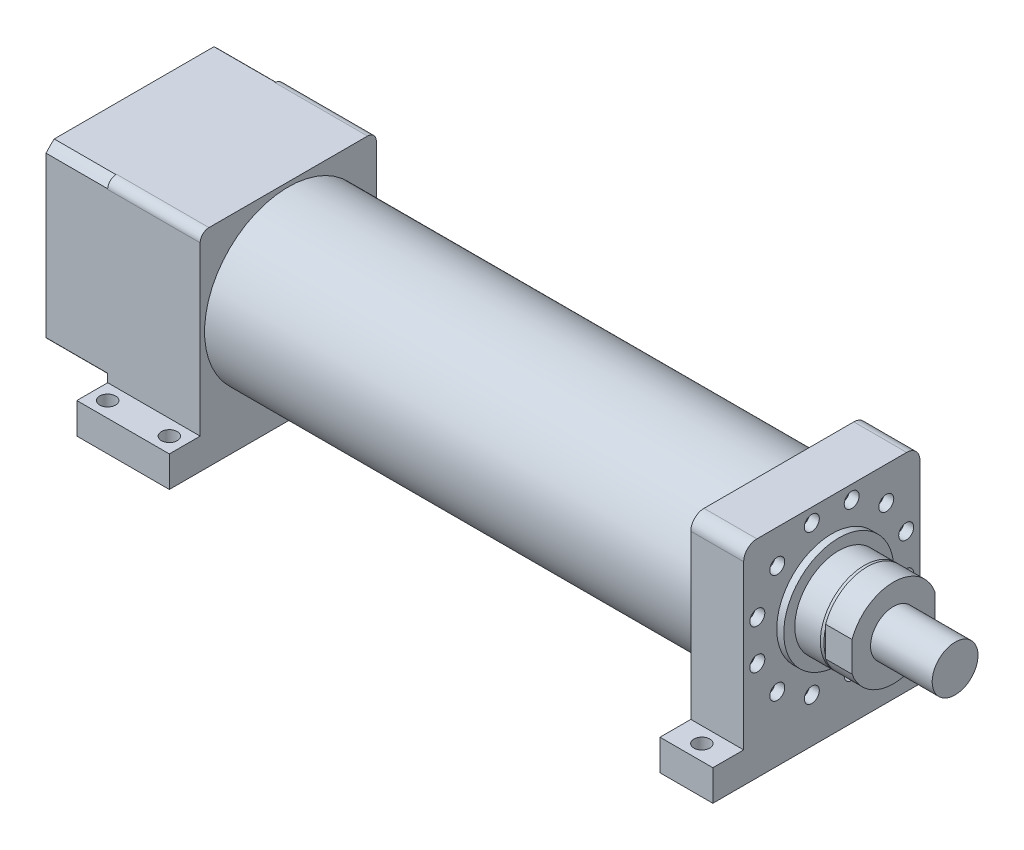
from build123d import *

# Parameters (mm, degrees)
SKETCH_1_R          = 95
SKETCH_1_R_2        = 80
EXTRUDE_1_DEPTH     = 557
EXTRUDE_2_DEPTH     = 60
SKETCH_3_R          = 62.5
EXTRUDE_3_DEPTH     = 8
SKETCH_4_R          = 8.5
CUT_EXTRUDE_3_DEPTH = 11
SKETCH_6_R          = 50
EXTRUDE_4_DEPTH     = 32
CHAMFER_1_SIZE      = 3
CHAMFER_1_SIZE2     = 1.091910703
EXTRUDE_5_DEPTH     = 30
SKETCH_8_R          = 26
CUT_EXTRUDE_4_DEPTH = 82
EXTRUDE_6_DEPTH     = 105
EXTRUDE_7_DEPTH     = 70
SKETCH_11_R         = 65
CUT_EXTRUDE_5_DEPTH = 30
SKETCH_12_R         = 55
CUT_EXTRUDE_6_DEPTH = 31
SKETCH_13_R         = 5
CUT_EXTRUDE_7_DEPTH = 20
SKETCH_8_2_R        = 26
EXTRUDE_8_DEPTH     = 70
SKETCH_14_W         = 105
SKETCH_14_H         = 270
SKETCH_14_R         = 9
SKETCH_14_W_2       = 60
EXTRUDE_12_DEPTH    = 35


with BuildPart() as part:
    # Sketch 1 → Extrude 1 (new body)
    with BuildSketch(Plane(origin=(0, 0, 0), x_dir=(0, 0, -1), z_dir=(1, 0, 0))):
        Circle(SKETCH_1_R)
        Circle(SKETCH_1_R_2, mode=Mode.SUBTRACT)
    extrude(amount=EXTRUDE_1_DEPTH)

    # Sketch 2 → Extrude 2 (add)
    with BuildSketch(Plane(origin=(557, 0, 0), x_dir=(0, 0, -1), z_dir=(1, 0, 0))):
        with BuildLine():
            Line((-100, -85), (-100, -100))
            Line((-100, -100), (-85, -100))
            Line((-85, -100), (85, -100))
            Line((85, -100), (100, -100))
            Line((100, -100), (100, -85))
            Line((100, -85), (100, 85))
            ThreePointArc((100, 85), (95.606601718, 95.606601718), (85, 100))
            Line((85, 100), (-85, 100))
            ThreePointArc((-85, 100), (-95.606601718, 95.606601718), (-100, 85))
            Line((-100, 85), (-100, -85))
        make_face()
    extrude(amount=EXTRUDE_2_DEPTH)

    # Sketch 3 → Extrude 3 (add)
    with BuildSketch(Plane(origin=(617, 0, 0), x_dir=(0, 0, -1), z_dir=(1, 0, 0))):
        Circle(SKETCH_3_R)
    extrude(amount=EXTRUDE_3_DEPTH)

    # Sketch 4 → Cut-Extrude 3 (cut)
    with BuildSketch(Plane(origin=(617, 0, 0), x_dir=(0, 0, -1), z_dir=(1, 0, 0))):
        with Locations((-22.646666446, 84.5185098)):
            Circle(SKETCH_4_R)
        with Locations((22.646666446, 84.5185098)):
            Circle(SKETCH_4_R)
        with Locations((61.871843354, 61.871843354)):
            Circle(SKETCH_4_R)
        with Locations((84.5185098, 22.646666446)):
            Circle(SKETCH_4_R)
        with Locations((84.5185098, -22.646666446)):
            Circle(SKETCH_4_R)
        with Locations((61.871843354, -61.871843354)):
            Circle(SKETCH_4_R)
        with Locations((22.646666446, -84.5185098)):
            Circle(SKETCH_4_R)
        with Locations((-22.646666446, -84.5185098)):
            Circle(SKETCH_4_R)
        with Locations((-61.871843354, -61.871843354)):
            Circle(SKETCH_4_R)
        with Locations((-84.5185098, -22.646666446)):
            Circle(SKETCH_4_R)
        with Locations((-84.5185098, 22.646666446)):
            Circle(SKETCH_4_R)
        with Locations((-61.871843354, 61.871843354)):
            Circle(SKETCH_4_R)
    extrude(amount=-CUT_EXTRUDE_3_DEPTH, mode=Mode.SUBTRACT)

    # Sketch 6 → Extrude 4 (add)
    with BuildSketch(Plane(origin=(625, 0, 0), x_dir=(0, 0, -1), z_dir=(1, 0, 0))):
        Circle(SKETCH_6_R)
    extrude(amount=EXTRUDE_4_DEPTH)

    # Chamfer 1
    chamfer_1_edges = [part.edges().sort_by_distance(p)[0] for p in [
        (657, 0, 50),
    ]]
    chamfer_1_side = [part.faces().sort_by_distance(p)[0] for p in [
        (641, 0, 50),
    ]]
    chamfer(chamfer_1_edges, length=CHAMFER_1_SIZE, length2=CHAMFER_1_SIZE2, reference=chamfer_1_side[0])

    # Sketch 7 → Extrude 5 (add)
    with BuildSketch(Plane(origin=(657, 0, 0), x_dir=(0, 0, -1), z_dir=(1, 0, 0))):
        with BuildLine():
            Line((-47, 17.058722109), (-47, -17.058722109))
            ThreePointArc((-47, -17.058722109), (0, -50), (47, -17.058722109))
            Line((47, -17.058722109), (47, 17.058722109))
            ThreePointArc((47, 17.058722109), (0, 50), (-47, 17.058722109))
        make_face()
    extrude(amount=EXTRUDE_5_DEPTH)

    # Sketch 8 → Cut-Extrude 4 (cut)
    with BuildSketch(Plane(origin=(687, 0, 0), x_dir=(0, 0, -1), z_dir=(1, 0, 0))):
        Circle(SKETCH_8_R)
    extrude(amount=-CUT_EXTRUDE_4_DEPTH, mode=Mode.SUBTRACT)

    # Sketch 9 → Extrude 6 (add)
    with BuildSketch(Plane.ZY):
        with BuildLine():
            Line((100, -90), (100, -100))
            Line((100, -100), (90, -100))
            Line((90, -100), (-90, -100))
            Line((-90, -100), (-100, -100))
            Line((-100, -100), (-100, -90))
            Line((-100, -90), (-100, 90))
            ThreePointArc((-100, 90), (-97.071067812, 97.071067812), (-90, 100))
            Line((-90, 100), (90, 100))
            ThreePointArc((90, 100), (97.071067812, 97.071067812), (100, 90))
            Line((100, 90), (100, -90))
        make_face()
    extrude(amount=EXTRUDE_6_DEPTH)



with BuildPart() as body_2:
    # Sketch 10 → Extrude 7 (new body)
    with BuildSketch(Plane.ZY.offset(105)):
        with BuildLine():
            Line((-90.691785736, 100), (90.691785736, 100))
            ThreePointArc((90.691785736, 100), (95.45941546, 95.45941546), (100, 90.691785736))
            Line((100, 90.691785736), (100, -90.691785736))
            ThreePointArc((100, -90.691785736), (95.45941546, -95.45941546), (90.691785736, -100))
            Line((90.691785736, -100), (-90.691785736, -100))
            ThreePointArc((-90.691785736, -100), (-95.45941546, -95.45941546), (-100, -90.691785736))
            Line((-100, -90.691785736), (-100, 90.691785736))
            ThreePointArc((-100, 90.691785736), (-95.45941546, 95.45941546), (-90.691785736, 100))
        make_face()
    extrude(amount=EXTRUDE_7_DEPTH)

    # Sketch 11 → Cut-Extrude 5 (cut)
    with BuildSketch(Plane.ZY.offset(175)):
        Circle(SKETCH_11_R)
    extrude(amount=-CUT_EXTRUDE_5_DEPTH, mode=Mode.SUBTRACT)

    # Sketch 12 → Cut-Extrude 6 (cut)
    with BuildSketch(Plane.ZY.offset(145)):
        Circle(SKETCH_12_R)
    extrude(amount=-CUT_EXTRUDE_6_DEPTH, mode=Mode.SUBTRACT)

    # Sketch 13 → Cut-Extrude 7 (cut)
    with BuildSketch(Plane.ZY.offset(175)):
        with Locations((-58.336309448, 58.336309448)):
            Circle(SKETCH_13_R)
        with Locations((58.336309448, 58.336309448)):
            Circle(SKETCH_13_R)
        with Locations((58.336309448, -58.336309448)):
            Circle(SKETCH_13_R)
        with Locations((-58.336309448, -58.336309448)):
            Circle(SKETCH_13_R)
    extrude(amount=-CUT_EXTRUDE_7_DEPTH, mode=Mode.SUBTRACT)


with BuildPart() as body_3:
    # Sketch 8_2 → Extrude 8 (new body)
    with BuildSketch(Plane(origin=(687, 0, 0), x_dir=(0, 0, -1), z_dir=(1, 0, 0))):
        Circle(SKETCH_8_2_R)
    extrude(amount=EXTRUDE_8_DEPTH)


with BuildPart() as part_1:
    add(part.part)

    add(body_2.part)  # Extrude 12 merges body 2
    # Sketch 14 → Extrude 12 (add)
    # profile 1 of 2: a face of its own
    with BuildSketch(Plane.XZ.offset(100)):
        with Locations((-52.5, 0)):
            Rectangle(SKETCH_14_W, SKETCH_14_H)
        with Locations(Location((-87.5, 117.5, 0), (0, 0, 270))):
            Circle(SKETCH_14_R, mode=Mode.SUBTRACT)
        with Locations(Location((-17.5, 117.5, 0), (0, 0, 270))):
            Circle(SKETCH_14_R, mode=Mode.SUBTRACT)
        with Locations(Location((-87.5, -117.5, 0), (0, 0, 270))):
            Circle(SKETCH_14_R, mode=Mode.SUBTRACT)
        with Locations(Location((-17.5, -117.5, 0), (0, 0, 270))):
            Circle(SKETCH_14_R, mode=Mode.SUBTRACT)
    # profile 2 of 2: a face of its own
    with BuildSketch(Plane.XZ.offset(100)):
        with Locations((587, 0)):
            Rectangle(SKETCH_14_W_2, SKETCH_14_H)
        with Locations(Location((587, 117.5, 0), (0, 0, 270))):
            Circle(SKETCH_14_R, mode=Mode.SUBTRACT)
        with Locations(Location((587, -117.5, 0), (0, 0, 270))):
            Circle(SKETCH_14_R, mode=Mode.SUBTRACT)
    extrude(amount=EXTRUDE_12_DEPTH)


solid = Compound([body_3.part, part_1.part])
